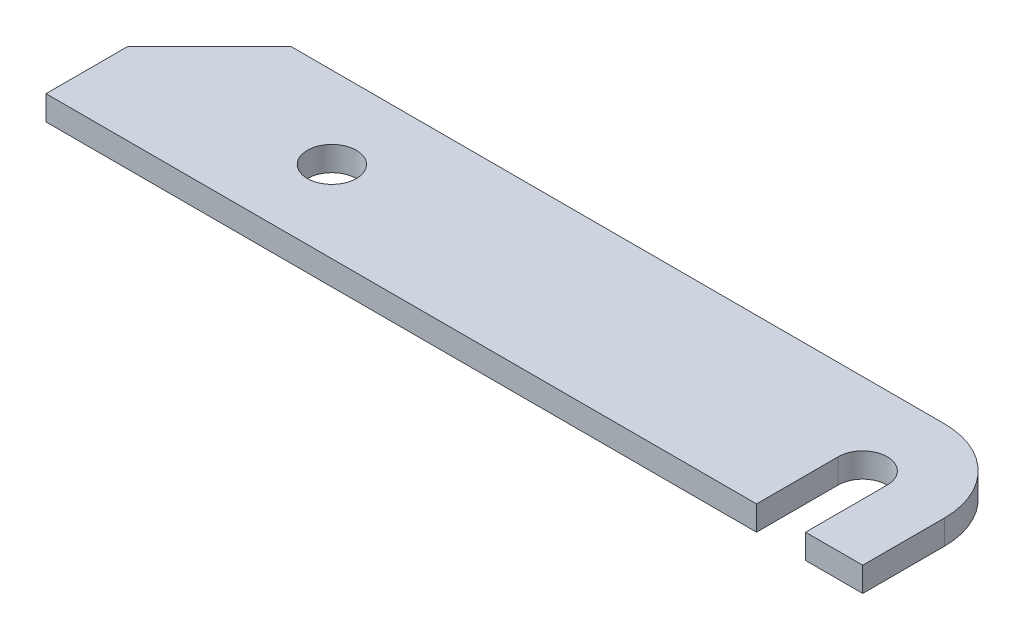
from build123d import *

# Parameters (mm, degrees)
SKETCH1_R      = 3
EXTRUDE1_DEPTH = 3


with BuildPart() as part:
    # Sketch1 → Extrude1 (new body)
    with BuildSketch(Plane(origin=(0, 0, 0), x_dir=(1, 0, 0), z_dir=(0, 1, 0))):
        with BuildLine():
            Line((93, 0), (100, 0))
            Line((100, 0), (100, 10))
            ThreePointArc((100, 10), (97.071067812, 17.071067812), (90, 20))
            Line((90, 20), (10, 20))
            Line((10, 20), (0, 10))
            Line((0, 10), (0, 0))
            Line((0, 0), (87, 0))
            Line((87, 0), (87, 10))
            ThreePointArc((87, 10), (90, 13), (93, 10))
            Line((93, 10), (93, 0))
        make_face()
        with Locations(Location((25, 10, 0), (0, 0, 270))):
            Circle(SKETCH1_R, mode=Mode.SUBTRACT)
    extrude(amount=EXTRUDE1_DEPTH)


solid = part.part
